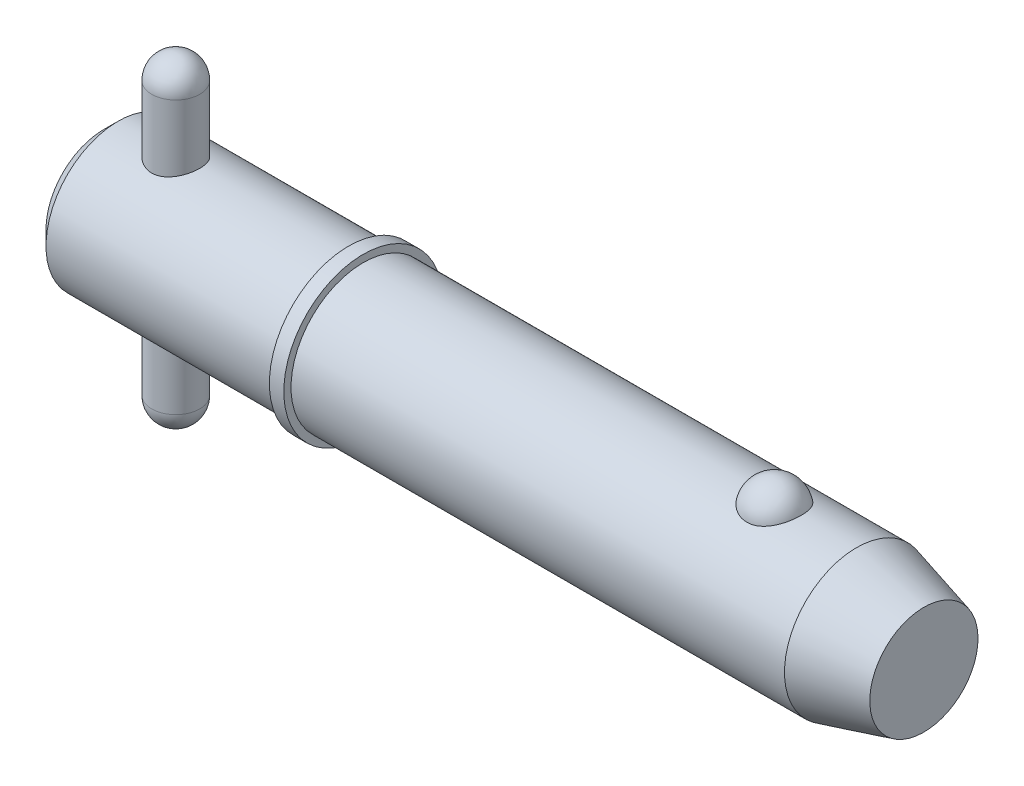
ISO-10303-21;
HEADER;
FILE_DESCRIPTION(('STEP AP214'),'2;1');
FILE_NAME('part.step','',(''),(''),'','','');
FILE_SCHEMA(('AUTOMOTIVE_DESIGN { 1 0 10303 214 1 1 1 1 }'));
ENDSEC;
DATA;
#1=APPLICATION_CONTEXT('core data for automotive mechanical design processes');
#2=APPLICATION_PROTOCOL_DEFINITION('international standard','automotive_design',2000,#1);
#3=PRODUCT_CONTEXT('',#1,'mechanical');
#4=PRODUCT('Part','Part','',(#3));
#5=PRODUCT_RELATED_PRODUCT_CATEGORY('part','',(#4));
#6=PRODUCT_DEFINITION_FORMATION('','',#4);
#7=PRODUCT_DEFINITION_CONTEXT('part definition',#1,'design');
#8=PRODUCT_DEFINITION('design','',#6,#7);
#9=PRODUCT_DEFINITION_SHAPE('','',#8);
#10=(LENGTH_UNIT() NAMED_UNIT(*) SI_UNIT(.MILLI.,.METRE.));
#11=(NAMED_UNIT(*) PLANE_ANGLE_UNIT() SI_UNIT($,.RADIAN.));
#12=(NAMED_UNIT(*) SI_UNIT($,.STERADIAN.) SOLID_ANGLE_UNIT());
#13=UNCERTAINTY_MEASURE_WITH_UNIT(LENGTH_MEASURE(1.E-05),#10,'distance_accuracy_value','');
#14=(GEOMETRIC_REPRESENTATION_CONTEXT(3) GLOBAL_UNCERTAINTY_ASSIGNED_CONTEXT((#13)) GLOBAL_UNIT_ASSIGNED_CONTEXT((#10,
#11,#12)) REPRESENTATION_CONTEXT('',''));
#15=CARTESIAN_POINT('',(0.,0.,0.));
#16=DIRECTION('',(0.,0.,1.));
#17=DIRECTION('',(1.,0.,0.));
#18=AXIS2_PLACEMENT_3D('',#15,#16,#17);
#19=CARTESIAN_POINT('',(7.14,15.875,0.));
#20=DIRECTION('',(0.,-1.,0.));
#21=DIRECTION('',(0.,0.,-1.));
#22=AXIS2_PLACEMENT_3D('',#19,#20,#21);
#23=CYLINDRICAL_SURFACE('',#22,2.38);
#24=CARTESIAN_POINT('',(7.14,-13.495,0.));
#25=DIRECTION('',(0.,-1.,0.));
#26=DIRECTION('',(0.,0.,-1.));
#27=AXIS2_PLACEMENT_3D('',#24,#25,#26);
#28=CIRCLE('',#27,2.38);
#29=CARTESIAN_POINT('',(7.14,-13.495,-2.38));
#30=VERTEX_POINT('',#29);
#31=EDGE_CURVE('P0_E10',#30,#30,#28,.F.);
#32=ORIENTED_EDGE('',*,*,#31,.T.);
#33=EDGE_LOOP('',(#32));
#34=FACE_BOUND('',#33,.T.);
#35=CARTESIAN_POINT('',(7.14,13.495,0.));
#36=DIRECTION('',(0.,-1.,0.));
#37=DIRECTION('',(0.,0.,-1.));
#38=AXIS2_PLACEMENT_3D('',#35,#36,#37);
#39=CIRCLE('',#38,2.38);
#40=CARTESIAN_POINT('',(7.14,13.495,-2.38));
#41=VERTEX_POINT('',#40);
#42=EDGE_CURVE('P0_E21',#41,#41,#39,.T.);
#43=ORIENTED_EDGE('',*,*,#42,.T.);
#44=EDGE_LOOP('',(#43));
#45=FACE_BOUND('',#44,.T.);
#46=ADVANCED_FACE('P0_F14',(#34,#45),#23,.T.);
#47=CARTESIAN_POINT('',(7.14,-13.495,0.));
#48=DIRECTION('',(0.,0.,1.));
#49=DIRECTION('',(1.,0.,0.));
#50=AXIS2_PLACEMENT_3D('',#47,#48,#49);
#51=SPHERICAL_SURFACE('',#50,2.38);
#52=CARTESIAN_POINT('',(7.14,-13.495,0.));
#53=DIRECTION('',(0.,-1.,0.));
#54=DIRECTION('',(0.,0.,-1.));
#55=AXIS2_PLACEMENT_3D('',#52,#53,#54);
#56=SPHERICAL_SURFACE('',#55,2.38);
#57=ORIENTED_EDGE('',*,*,#31,.F.);
#58=EDGE_LOOP('',(#57));
#59=FACE_BOUND('',#58,.T.);
#60=ADVANCED_FACE('P0_F29',(#59),#56,.T.);
#61=CARTESIAN_POINT('',(7.14,13.495,0.));
#62=DIRECTION('',(0.,0.,1.));
#63=DIRECTION('',(1.,0.,0.));
#64=AXIS2_PLACEMENT_3D('',#61,#62,#63);
#65=SPHERICAL_SURFACE('',#64,2.38);
#66=CARTESIAN_POINT('',(7.14,13.495,0.));
#67=DIRECTION('',(0.,-1.,0.));
#68=DIRECTION('',(0.,0.,-1.));
#69=AXIS2_PLACEMENT_3D('',#66,#67,#68);
#70=SPHERICAL_SURFACE('',#69,2.38);
#71=ORIENTED_EDGE('',*,*,#42,.F.);
#72=EDGE_LOOP('',(#71));
#73=FACE_BOUND('',#72,.T.);
#74=ADVANCED_FACE('P0_F16',(#73),#70,.T.);
#75=CLOSED_SHELL('',(#46,#60,#74));
#76=MANIFOLD_SOLID_BREP('P0_B1',#75);
#77=CARTESIAN_POINT('',(0.,0.,0.));
#78=DIRECTION('',(1.,0.,0.));
#79=DIRECTION('',(0.,0.,-1.));
#80=AXIS2_PLACEMENT_3D('',#77,#78,#79);
#81=CYLINDRICAL_SURFACE('',#80,7.145);
#82=CARTESIAN_POINT('',(74.5836242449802,0.,0.));
#83=DIRECTION('',(1.,0.,0.));
#84=DIRECTION('',(0.,0.,-1.));
#85=AXIS2_PLACEMENT_3D('',#82,#83,#84);
#86=CIRCLE('',#85,7.145);
#87=CARTESIAN_POINT('',(74.5836242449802,0.,-7.145));
#88=VERTEX_POINT('',#87);
#89=EDGE_CURVE('P1_E81',#88,#88,#86,.T.);
#90=ORIENTED_EDGE('',*,*,#89,.F.);
#91=EDGE_LOOP('',(#90));
#92=FACE_BOUND('',#91,.T.);
#93=CARTESIAN_POINT('',(25.7,0.,0.));
#94=DIRECTION('',(1.,0.,0.));
#95=DIRECTION('',(0.,0.,-1.));
#96=AXIS2_PLACEMENT_3D('',#93,#94,#95);
#97=CIRCLE('',#96,7.145);
#98=CARTESIAN_POINT('',(25.7,0.,-7.145));
#99=VERTEX_POINT('',#98);
#100=EDGE_CURVE('P1_E85',#99,#99,#97,.T.);
#101=ORIENTED_EDGE('',*,*,#100,.T.);
#102=EDGE_LOOP('',(#101));
#103=FACE_BOUND('',#102,.T.);
#104=CARTESIAN_POINT('',(66.4395037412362,6.60328629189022,2.72903557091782));
#105=CARTESIAN_POINT('',(66.2983158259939,6.60329644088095,2.72902496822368));
#106=CARTESIAN_POINT('',(66.1568832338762,6.60799490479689,2.71772840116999));
#107=CARTESIAN_POINT('',(65.8779557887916,6.62628236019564,2.67281935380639));
#108=CARTESIAN_POINT('',(65.7404726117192,6.63989534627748,2.63914664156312));
#109=CARTESIAN_POINT('',(65.4738894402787,6.67440775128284,2.55059642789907));
#110=CARTESIAN_POINT('',(65.3447683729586,6.69528793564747,2.49577486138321));
#111=CARTESIAN_POINT('',(65.0978694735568,6.74205585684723,2.36651799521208));
#112=CARTESIAN_POINT('',(64.9800865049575,6.76794130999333,2.29209163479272));
#113=CARTESIAN_POINT('',(64.7551671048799,6.82286177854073,2.12312937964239));
#114=CARTESIAN_POINT('',(64.6484405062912,6.85196655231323,2.02807107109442));
#115=CARTESIAN_POINT('',(64.4519181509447,6.90970232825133,1.82167822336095));
#116=CARTESIAN_POINT('',(64.3621276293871,6.93833318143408,1.71033867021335));
#117=CARTESIAN_POINT('',(64.1976670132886,6.9935167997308,1.46891951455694));
#118=CARTESIAN_POINT('',(64.123844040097,7.01992110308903,1.33822781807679));
#119=CARTESIAN_POINT('',(63.9980884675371,7.06643385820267,1.0656656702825));
#120=CARTESIAN_POINT('',(63.9461573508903,7.08654188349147,0.923794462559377));
#121=CARTESIAN_POINT('',(63.8647323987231,7.11862399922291,0.630993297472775));
#122=CARTESIAN_POINT('',(63.8355167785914,7.13049704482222,0.479974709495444));
#123=CARTESIAN_POINT('',(63.8011742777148,7.14449484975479,0.174782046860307));
#124=CARTESIAN_POINT('',(63.7960466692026,7.14661990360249,0.0206080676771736));
#125=CARTESIAN_POINT('',(63.809938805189,7.14092465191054,-0.285506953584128));
#126=CARTESIAN_POINT('',(63.8288101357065,7.1331654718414,-0.437455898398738));
#127=CARTESIAN_POINT('',(63.8900622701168,7.10859076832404,-0.73577860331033));
#128=CARTESIAN_POINT('',(63.9324435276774,7.0917750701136,-0.882152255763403));
#129=CARTESIAN_POINT('',(64.0399346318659,7.05076716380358,-1.16543149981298));
#130=CARTESIAN_POINT('',(64.1050759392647,7.02656475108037,-1.30232366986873));
#131=CARTESIAN_POINT('',(64.2567597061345,6.97329145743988,-1.56265907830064));
#132=CARTESIAN_POINT('',(64.343303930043,6.94422017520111,-1.68610120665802));
#133=CARTESIAN_POINT('',(64.5364654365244,6.88415108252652,-1.91671004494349));
#134=CARTESIAN_POINT('',(64.6431807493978,6.85314438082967,-2.02379244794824));
#135=CARTESIAN_POINT('',(64.8739740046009,6.79282069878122,-2.21787433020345));
#136=CARTESIAN_POINT('',(64.9980505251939,6.76350358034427,-2.30487545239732));
#137=CARTESIAN_POINT('',(65.2576784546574,6.7106058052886,-2.45458647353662));
#138=CARTESIAN_POINT('',(65.3929387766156,6.68691885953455,-2.5177624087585));
#139=CARTESIAN_POINT('',(65.6732778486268,6.64741247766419,-2.62030218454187));
#140=CARTESIAN_POINT('',(65.818352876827,6.63159007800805,-2.65967499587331));
#141=CARTESIAN_POINT('',(66.1063475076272,6.61038594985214,-2.71193301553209));
#142=CARTESIAN_POINT('',(66.2490080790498,6.60451880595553,-2.72605165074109));
#143=CARTESIAN_POINT('',(66.5348004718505,6.60240611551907,-2.73116688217));
#144=CARTESIAN_POINT('',(66.6779321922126,6.60615862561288,-2.72216814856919));
#145=CARTESIAN_POINT('',(66.9558486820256,6.6225609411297,-2.68200435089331));
#146=CARTESIAN_POINT('',(67.0907542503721,6.63492533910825,-2.65154998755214));
#147=CARTESIAN_POINT('',(67.35332009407,6.66687445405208,-2.57015684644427));
#148=CARTESIAN_POINT('',(67.4809797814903,6.68645975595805,-2.51921640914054));
#149=CARTESIAN_POINT('',(67.728577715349,6.73127274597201,-2.39693610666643));
#150=CARTESIAN_POINT('',(67.8482878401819,6.7566138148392,-2.32517694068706));
#151=CARTESIAN_POINT('',(68.0741592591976,6.8100600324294,-2.1636381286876));
#152=CARTESIAN_POINT('',(68.180317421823,6.83816581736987,-2.07385432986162));
#153=CARTESIAN_POINT('',(68.3818620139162,6.89580469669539,-1.87357235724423));
#154=CARTESIAN_POINT('',(68.476440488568,6.92533863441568,-1.76226074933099));
#155=CARTESIAN_POINT('',(68.6463329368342,6.98139526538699,-1.52511696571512));
#156=CARTESIAN_POINT('',(68.7216434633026,7.0079174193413,-1.39928219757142));
#157=CARTESIAN_POINT('',(68.8535955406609,7.05607625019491,-1.1321597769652));
#158=CARTESIAN_POINT('',(68.9095688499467,7.07753119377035,-0.990508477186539));
#159=CARTESIAN_POINT('',(68.9982965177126,7.11222355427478,-0.699154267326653));
#160=CARTESIAN_POINT('',(69.0310506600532,7.12546089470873,-0.549451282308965));
#161=CARTESIAN_POINT('',(69.0726899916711,7.1423758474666,-0.246120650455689));
#162=CARTESIAN_POINT('',(69.081558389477,7.14604673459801,-0.0924903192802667));
#163=CARTESIAN_POINT('',(69.0751940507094,7.14343510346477,0.214181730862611));
#164=CARTESIAN_POINT('',(69.0599618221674,7.13715279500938,0.367223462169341));
#165=CARTESIAN_POINT('',(69.0058451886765,7.11532948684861,0.667595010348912));
#166=CARTESIAN_POINT('',(68.9670776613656,7.09983424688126,0.814949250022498));
#167=CARTESIAN_POINT('',(68.8667700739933,7.06119140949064,1.10063221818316));
#168=CARTESIAN_POINT('',(68.8052284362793,7.03804328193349,1.23896032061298));
#169=CARTESIAN_POINT('',(68.6602071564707,6.98632429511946,1.5035230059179));
#170=CARTESIAN_POINT('',(68.5766067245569,6.95772382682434,1.62968561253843));
#171=CARTESIAN_POINT('',(68.3893804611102,6.89823072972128,1.865543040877));
#172=CARTESIAN_POINT('',(68.2857557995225,6.86733823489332,1.9752388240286));
#173=CARTESIAN_POINT('',(68.0610769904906,6.80676456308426,2.17482293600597));
#174=CARTESIAN_POINT('',(67.9400673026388,6.77708053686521,2.26476035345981));
#175=CARTESIAN_POINT('',(67.6833408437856,6.7223050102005,2.42252989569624));
#176=CARTESIAN_POINT('',(67.54761851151,6.69721525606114,2.49035362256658));
#177=CARTESIAN_POINT('',(67.2704022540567,6.65552591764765,2.59967646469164));
#178=CARTESIAN_POINT('',(67.1292810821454,6.63865794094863,2.64202017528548));
#179=CARTESIAN_POINT('',(66.8414448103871,6.61425039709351,2.70255841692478));
#180=CARTESIAN_POINT('',(66.6947480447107,6.60668259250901,2.720826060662));
#181=CARTESIAN_POINT('',(66.5116799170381,6.60358754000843,2.72830331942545));
#182=CARTESIAN_POINT('',(66.4755998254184,6.60328369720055,2.72903828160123));
#183=CARTESIAN_POINT('',(66.4395037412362,6.60328629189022,2.72903557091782));
#184=B_SPLINE_CURVE_WITH_KNOTS('',3,(#104,#105,#106,#107,#108,#109,#110,#111,#112,#113,#114,
#115,#116,#117,#118,#119,#120,#121,#122,#123,#124,#125,#126,#127,#128,#129,#130,#131,#132,#133,
#134,#135,#136,#137,#138,#139,#140,#141,#142,#143,#144,#145,#146,#147,#148,#149,#150,#151,#152,
#153,#154,#155,#156,#157,#158,#159,#160,#161,#162,#163,#164,#165,#166,#167,#168,#169,#170,#171,
#172,#173,#174,#175,#176,#177,#178,#179,#180,#181,#182,#183),.UNSPECIFIED.,.T.,.F.,(4,2,2,2,2,2,
2,2,2,2,2,2,2,2,2,2,2,2,2,2,2,2,2,2,2,2,2,2,2,2,2,2,2,2,2,2,2,2,2,4),(0.,0.423468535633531,
0.848081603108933,1.27157926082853,1.69488414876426,2.13051395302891,2.56627819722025,
3.0213670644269,3.47648674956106,3.93709649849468,4.39769233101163,4.85545355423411,
5.31322361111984,5.77162895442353,6.23007210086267,6.69080337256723,7.15149693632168,
7.60264329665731,8.05361952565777,8.48189729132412,8.91008854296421,9.32472524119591,
9.73939553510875,10.1630783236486,10.5868588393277,11.0319070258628,11.4770347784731,
11.9362874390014,12.3955443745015,12.855124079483,13.3146940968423,13.7720003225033,
14.2293382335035,14.6892343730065,15.1491036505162,15.6078171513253,16.0667046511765,
16.5093965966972,16.9507410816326,17.059004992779),.UNSPECIFIED.);
#185=CARTESIAN_POINT('',(66.4395037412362,6.60328629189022,2.72903557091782));
#186=VERTEX_POINT('',#185);
#187=EDGE_CURVE('P1_E35',#186,#186,#184,.T.);
#188=ORIENTED_EDGE('',*,*,#187,.T.);
#189=EDGE_LOOP('',(#188));
#190=FACE_BOUND('',#189,.T.);
#191=ADVANCED_FACE('P1_F13',(#92,#103,#190),#81,.T.);
#192=CARTESIAN_POINT('',(0.,0.,0.));
#193=DIRECTION('',(-1.,0.,0.));
#194=DIRECTION('',(0.,0.,1.));
#195=AXIS2_PLACEMENT_3D('',#192,#193,#194);
#196=PLANE('',#195);
#197=CARTESIAN_POINT('',(0.,0.,0.));
#198=DIRECTION('',(1.,0.,0.));
#199=DIRECTION('',(0.,0.,-1.));
#200=AXIS2_PLACEMENT_3D('',#197,#198,#199);
#201=CIRCLE('',#200,5.716);
#202=CARTESIAN_POINT('',(0.,0.,-5.716));
#203=VERTEX_POINT('',#202);
#204=EDGE_CURVE('P1_E9',#203,#203,#201,.T.);
#205=ORIENTED_EDGE('',*,*,#204,.F.);
#206=EDGE_LOOP('',(#205));
#207=FACE_BOUND('',#206,.T.);
#208=ADVANCED_FACE('P1_F15',(#207),#196,.T.);
#209=CARTESIAN_POINT('',(1.42899999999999,0.,0.));
#210=DIRECTION('',(1.,0.,0.));
#211=DIRECTION('',(0.,0.,-1.));
#212=AXIS2_PLACEMENT_3D('',#209,#210,#211);
#213=CONICAL_SURFACE('',#212,7.145,0.78539816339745);
#214=ORIENTED_EDGE('',*,*,#204,.T.);
#215=EDGE_LOOP('',(#214));
#216=FACE_BOUND('',#215,.T.);
#217=CARTESIAN_POINT('',(1.42899999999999,0.,0.));
#218=DIRECTION('',(1.,0.,0.));
#219=DIRECTION('',(0.,0.,-1.));
#220=AXIS2_PLACEMENT_3D('',#217,#218,#219);
#221=CIRCLE('',#220,7.145);
#222=CARTESIAN_POINT('',(1.42899999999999,0.,-7.145));
#223=VERTEX_POINT('',#222);
#224=EDGE_CURVE('P1_E26',#223,#223,#221,.T.);
#225=ORIENTED_EDGE('',*,*,#224,.F.);
#226=EDGE_LOOP('',(#225));
#227=FACE_BOUND('',#226,.T.);
#228=ADVANCED_FACE('P1_F77',(#216,#227),#213,.T.);
#229=CARTESIAN_POINT('',(0.,0.,0.));
#230=DIRECTION('',(1.,0.,0.));
#231=DIRECTION('',(0.,0.,-1.));
#232=AXIS2_PLACEMENT_3D('',#229,#230,#231);
#233=CYLINDRICAL_SURFACE('',#232,7.145);
#234=CARTESIAN_POINT('',(7.14,-6.73695962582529,2.38));
#235=CARTESIAN_POINT('',(7.01035997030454,-6.73695921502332,2.38000059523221));
#236=CARTESIAN_POINT('',(6.88072348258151,-6.74074253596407,2.36937183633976));
#237=CARTESIAN_POINT('',(6.62529075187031,-6.75538853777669,2.32728080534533));
#238=CARTESIAN_POINT('',(6.49949514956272,-6.76625239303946,2.29581507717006));
#239=CARTESIAN_POINT('',(6.2554858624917,-6.79369535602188,2.21327763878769));
#240=CARTESIAN_POINT('',(6.13725786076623,-6.81026326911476,2.16224430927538));
#241=CARTESIAN_POINT('',(5.91100349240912,-6.84723128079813,2.04215132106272));
#242=CARTESIAN_POINT('',(5.80297937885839,-6.86763222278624,1.97308769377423));
#243=CARTESIAN_POINT('',(5.59597854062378,-6.91086152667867,1.81600414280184));
#244=CARTESIAN_POINT('',(5.49745861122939,-6.93375032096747,1.72739874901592));
#245=CARTESIAN_POINT('',(5.31636508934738,-6.97886546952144,1.53499636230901));
#246=CARTESIAN_POINT('',(5.23379405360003,-7.00109171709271,1.43119693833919));
#247=CARTESIAN_POINT('',(5.08487013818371,-7.04307708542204,1.20801318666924));
#248=CARTESIAN_POINT('',(5.01899578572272,-7.06275685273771,1.08829330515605));
#249=CARTESIAN_POINT('',(4.90850130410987,-7.09671988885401,0.838703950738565));
#250=CARTESIAN_POINT('',(4.86387545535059,-7.11100460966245,0.70883722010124));
#251=CARTESIAN_POINT('',(4.79869354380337,-7.13213998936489,0.44742990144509));
#252=CARTESIAN_POINT('',(4.77735497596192,-7.13923172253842,0.316104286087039));
#253=CARTESIAN_POINT('',(4.75686536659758,-7.14603777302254,0.0515578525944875));
#254=CARTESIAN_POINT('',(4.75770861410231,-7.14575398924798,-0.0816624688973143));
#255=CARTESIAN_POINT('',(4.78106216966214,-7.13800438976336,-0.340678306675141));
#256=CARTESIAN_POINT('',(4.80272255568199,-7.13082030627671,-0.466560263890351));
#257=CARTESIAN_POINT('',(4.86569013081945,-7.11043095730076,-0.712788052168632));
#258=CARTESIAN_POINT('',(4.90699865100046,-7.09722528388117,-0.833133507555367));
#259=CARTESIAN_POINT('',(5.00858673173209,-7.06591754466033,-1.06673173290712));
#260=CARTESIAN_POINT('',(5.06910834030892,-7.0477534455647,-1.17987058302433));
#261=CARTESIAN_POINT('',(5.20720514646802,-7.00841977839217,-1.39463797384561));
#262=CARTESIAN_POINT('',(5.28478508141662,-6.987249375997,-1.49626330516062));
#263=CARTESIAN_POINT('',(5.4590800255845,-6.94296010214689,-1.69017445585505));
#264=CARTESIAN_POINT('',(5.55652324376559,-6.91979641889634,-1.78179645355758));
#265=CARTESIAN_POINT('',(5.76558873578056,-6.87497076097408,-1.94761348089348));
#266=CARTESIAN_POINT('',(5.87721318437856,-6.85330901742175,-2.02180583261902));
#267=CARTESIAN_POINT('',(6.11357367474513,-6.81369485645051,-2.15157488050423));
#268=CARTESIAN_POINT('',(6.23847358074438,-6.79579956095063,-2.20687188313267));
#269=CARTESIAN_POINT('',(6.49655785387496,-6.76640630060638,-2.29542443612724));
#270=CARTESIAN_POINT('',(6.62973872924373,-6.75490565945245,-2.32868920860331));
#271=CARTESIAN_POINT('',(6.89417536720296,-6.74020933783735,-2.37088225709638));
#272=CARTESIAN_POINT('',(7.02524746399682,-6.73666278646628,-2.38083959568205));
#273=CARTESIAN_POINT('',(7.28721035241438,-6.73729555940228,-2.37904974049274));
#274=CARTESIAN_POINT('',(7.41810117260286,-6.7414734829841,-2.36730648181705));
#275=CARTESIAN_POINT('',(7.67130717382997,-6.75673471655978,-2.32337336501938));
#276=CARTESIAN_POINT('',(7.79376251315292,-6.76757635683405,-2.29189834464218));
#277=CARTESIAN_POINT('',(8.03162917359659,-6.79467771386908,-2.21025275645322));
#278=CARTESIAN_POINT('',(8.14703924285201,-6.8109383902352,-2.16007887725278));
#279=CARTESIAN_POINT('',(8.37159169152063,-6.84768362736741,-2.04065289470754));
#280=CARTESIAN_POINT('',(8.48041962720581,-6.86828569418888,-1.97084668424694));
#281=CARTESIAN_POINT('',(8.68518919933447,-6.91116416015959,-1.8147657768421));
#282=CARTESIAN_POINT('',(8.78112702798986,-6.93344105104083,-1.72848623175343));
#283=CARTESIAN_POINT('',(8.96215574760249,-6.97845348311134,-1.53698616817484));
#284=CARTESIAN_POINT('',(9.04650427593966,-7.00115965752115,-1.43105491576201));
#285=CARTESIAN_POINT('',(9.19627592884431,-7.04341676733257,-1.20598377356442));
#286=CARTESIAN_POINT('',(9.26169972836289,-7.06296781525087,-1.08684435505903));
#287=CARTESIAN_POINT('',(9.37116617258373,-7.0966205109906,-0.83933303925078));
#288=CARTESIAN_POINT('',(9.41534821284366,-7.11075755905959,-0.711027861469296));
#289=CARTESIAN_POINT('',(9.48132660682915,-7.13214194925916,-0.448245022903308));
#290=CARTESIAN_POINT('',(9.50313102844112,-7.13939177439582,-0.313769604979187));
#291=CARTESIAN_POINT('',(9.5230098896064,-7.14599771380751,-0.049254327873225));
#292=CARTESIAN_POINT('',(9.52215013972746,-7.14570837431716,0.0806974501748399));
#293=CARTESIAN_POINT('',(9.49935359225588,-7.13814116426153,0.338518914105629));
#294=CARTESIAN_POINT('',(9.47741850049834,-7.13086385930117,0.466388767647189));
#295=CARTESIAN_POINT('',(9.4138005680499,-7.11026814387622,0.714400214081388));
#296=CARTESIAN_POINT('',(9.37243609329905,-7.09704726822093,0.834632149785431));
#297=CARTESIAN_POINT('',(9.27142829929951,-7.06592602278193,1.06649582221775));
#298=CARTESIAN_POINT('',(9.2117816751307,-7.04802480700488,1.1781259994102));
#299=CARTESIAN_POINT('',(9.07336776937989,-7.00856499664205,1.39411030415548));
#300=CARTESIAN_POINT('',(8.99397590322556,-6.98689577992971,1.49804368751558));
#301=CARTESIAN_POINT('',(8.81938810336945,-6.9426110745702,1.69146078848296));
#302=CARTESIAN_POINT('',(8.72418713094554,-6.91999528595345,1.78093988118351));
#303=CARTESIAN_POINT('',(8.51623540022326,-6.87531507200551,1.94646188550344));
#304=CARTESIAN_POINT('',(8.4029442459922,-6.85330672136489,2.02184316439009));
#305=CARTESIAN_POINT('',(8.16461714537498,-6.81342065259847,2.1524427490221));
#306=CARTESIAN_POINT('',(8.03958429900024,-6.7955418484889,2.20766635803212));
#307=CARTESIAN_POINT('',(7.78712566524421,-6.76686117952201,2.29403636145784));
#308=CARTESIAN_POINT('',(7.66006989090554,-6.75577342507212,2.32616709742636));
#309=CARTESIAN_POINT('',(7.40200728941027,-6.74082409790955,2.36914495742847));
#310=CARTESIAN_POINT('',(7.27100183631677,-6.73696004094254,2.37999939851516));
#311=CARTESIAN_POINT('',(7.14,-6.73695962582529,2.38));
#312=B_SPLINE_CURVE_WITH_KNOTS('',3,(#234,#235,#236,#237,#238,#239,#240,#241,#242,#243,#244,
#245,#246,#247,#248,#249,#250,#251,#252,#253,#254,#255,#256,#257,#258,#259,#260,#261,#262,#263,
#264,#265,#266,#267,#268,#269,#270,#271,#272,#273,#274,#275,#276,#277,#278,#279,#280,#281,#282,
#283,#284,#285,#286,#287,#288,#289,#290,#291,#292,#293,#294,#295,#296,#297,#298,#299,#300,#301,
#302,#303,#304,#305,#306,#307,#308,#309,#310,#311),.UNSPECIFIED.,.T.,.F.,(4,2,2,2,2,2,2,2,2,2,2,
2,2,2,2,2,2,2,2,2,2,2,2,2,2,2,2,2,2,2,2,2,2,2,2,2,2,2,4),(0.,0.388434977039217,
0.776934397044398,1.16467566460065,1.55250234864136,1.9540847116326,2.35573139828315,
2.76784120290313,3.17984001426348,3.57752248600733,3.97510257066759,4.35711073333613,
4.7391447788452,5.12619663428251,5.51335611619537,5.91871976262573,6.3241456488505,
6.73533623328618,7.14635459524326,7.53885245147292,7.93127914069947,8.31025106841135,
8.68929014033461,9.08033871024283,9.47150254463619,9.88145528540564,10.2913934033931,
10.6986033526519,11.1056664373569,11.4936225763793,11.8815473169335,12.2633262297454,
12.645174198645,13.0411187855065,13.437189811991,13.8487371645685,14.2601761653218,
14.6528265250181,15.0453418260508),.UNSPECIFIED.);
#313=CARTESIAN_POINT('',(7.14,-6.73695962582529,2.38));
#314=VERTEX_POINT('',#313);
#315=EDGE_CURVE('P1_E17',#314,#314,#312,.T.);
#316=ORIENTED_EDGE('',*,*,#315,.F.);
#317=EDGE_LOOP('',(#316));
#318=FACE_BOUND('',#317,.T.);
#319=CARTESIAN_POINT('',(7.14,6.73695962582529,2.38));
#320=CARTESIAN_POINT('',(7.26964002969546,6.73695921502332,2.38000059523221));
#321=CARTESIAN_POINT('',(7.39927651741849,6.74074253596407,2.36937183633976));
#322=CARTESIAN_POINT('',(7.65470924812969,6.75538853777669,2.32728080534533));
#323=CARTESIAN_POINT('',(7.78050485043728,6.76625239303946,2.29581507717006));
#324=CARTESIAN_POINT('',(8.02451413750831,6.79369535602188,2.21327763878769));
#325=CARTESIAN_POINT('',(8.14274213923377,6.81026326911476,2.16224430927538));
#326=CARTESIAN_POINT('',(8.36899650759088,6.84723128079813,2.04215132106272));
#327=CARTESIAN_POINT('',(8.47702062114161,6.86763222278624,1.97308769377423));
#328=CARTESIAN_POINT('',(8.68402145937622,6.91086152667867,1.81600414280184));
#329=CARTESIAN_POINT('',(8.78254138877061,6.93375032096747,1.72739874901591));
#330=CARTESIAN_POINT('',(8.96363491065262,6.97886546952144,1.53499636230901));
#331=CARTESIAN_POINT('',(9.04620594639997,7.00109171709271,1.43119693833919));
#332=CARTESIAN_POINT('',(9.19512986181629,7.04307708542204,1.20801318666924));
#333=CARTESIAN_POINT('',(9.26100421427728,7.06275685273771,1.08829330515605));
#334=CARTESIAN_POINT('',(9.37149869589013,7.09671988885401,0.838703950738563));
#335=CARTESIAN_POINT('',(9.41612454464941,7.11100460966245,0.708837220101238));
#336=CARTESIAN_POINT('',(9.48130645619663,7.13213998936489,0.447429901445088));
#337=CARTESIAN_POINT('',(9.50264502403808,7.13923172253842,0.316104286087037));
#338=CARTESIAN_POINT('',(9.52313463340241,7.14603777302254,0.0515578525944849));
#339=CARTESIAN_POINT('',(9.52229138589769,7.14575398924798,-0.0816624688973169));
#340=CARTESIAN_POINT('',(9.49893783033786,7.13800438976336,-0.340678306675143));
#341=CARTESIAN_POINT('',(9.47727744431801,7.13082030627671,-0.466560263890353));
#342=CARTESIAN_POINT('',(9.41430986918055,7.11043095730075,-0.712788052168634));
#343=CARTESIAN_POINT('',(9.37300134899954,7.09722528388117,-0.833133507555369));
#344=CARTESIAN_POINT('',(9.27141326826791,7.06591754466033,-1.06673173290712));
#345=CARTESIAN_POINT('',(9.21089165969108,7.0477534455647,-1.17987058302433));
#346=CARTESIAN_POINT('',(9.07279485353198,7.00841977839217,-1.39463797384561));
#347=CARTESIAN_POINT('',(8.99521491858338,6.987249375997,-1.49626330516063));
#348=CARTESIAN_POINT('',(8.82091997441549,6.94296010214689,-1.69017445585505));
#349=CARTESIAN_POINT('',(8.72347675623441,6.91979641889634,-1.78179645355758));
#350=CARTESIAN_POINT('',(8.51441126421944,6.87497076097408,-1.94761348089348));
#351=CARTESIAN_POINT('',(8.40278681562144,6.85330901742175,-2.02180583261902));
#352=CARTESIAN_POINT('',(8.16642632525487,6.81369485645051,-2.15157488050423));
#353=CARTESIAN_POINT('',(8.04152641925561,6.79579956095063,-2.20687188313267));
#354=CARTESIAN_POINT('',(7.78344214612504,6.76640630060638,-2.29542443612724));
#355=CARTESIAN_POINT('',(7.65026127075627,6.75490565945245,-2.32868920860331));
#356=CARTESIAN_POINT('',(7.38582463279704,6.74020933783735,-2.37088225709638));
#357=CARTESIAN_POINT('',(7.25475253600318,6.73666278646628,-2.38083959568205));
#358=CARTESIAN_POINT('',(6.99278964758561,6.73729555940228,-2.37904974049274));
#359=CARTESIAN_POINT('',(6.86189882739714,6.7414734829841,-2.36730648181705));
#360=CARTESIAN_POINT('',(6.60869282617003,6.75673471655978,-2.32337336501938));
#361=CARTESIAN_POINT('',(6.48623748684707,6.76757635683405,-2.29189834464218));
#362=CARTESIAN_POINT('',(6.2483708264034,6.79467771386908,-2.21025275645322));
#363=CARTESIAN_POINT('',(6.13296075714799,6.8109383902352,-2.16007887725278));
#364=CARTESIAN_POINT('',(5.90840830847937,6.84768362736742,-2.04065289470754));
#365=CARTESIAN_POINT('',(5.79958037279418,6.86828569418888,-1.97084668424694));
#366=CARTESIAN_POINT('',(5.59481080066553,6.91116416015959,-1.8147657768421));
#367=CARTESIAN_POINT('',(5.49887297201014,6.93344105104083,-1.72848623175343));
#368=CARTESIAN_POINT('',(5.31784425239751,6.97845348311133,-1.53698616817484));
#369=CARTESIAN_POINT('',(5.23349572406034,7.00115965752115,-1.43105491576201));
#370=CARTESIAN_POINT('',(5.08372407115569,7.04341676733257,-1.20598377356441));
#371=CARTESIAN_POINT('',(5.01830027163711,7.06296781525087,-1.08684435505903));
#372=CARTESIAN_POINT('',(4.90883382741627,7.0966205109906,-0.839333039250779));
#373=CARTESIAN_POINT('',(4.86465178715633,7.11075755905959,-0.711027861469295));
#374=CARTESIAN_POINT('',(4.79867339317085,7.13214194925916,-0.448245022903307));
#375=CARTESIAN_POINT('',(4.77686897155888,7.13939177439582,-0.313769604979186));
#376=CARTESIAN_POINT('',(4.7569901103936,7.14599771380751,-0.0492543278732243));
#377=CARTESIAN_POINT('',(4.75784986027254,7.14570837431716,0.0806974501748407));
#378=CARTESIAN_POINT('',(4.78064640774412,7.13814116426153,0.33851891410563));
#379=CARTESIAN_POINT('',(4.80258149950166,7.13086385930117,0.46638876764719));
#380=CARTESIAN_POINT('',(4.8661994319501,7.11026814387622,0.714400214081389));
#381=CARTESIAN_POINT('',(4.90756390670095,7.09704726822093,0.834632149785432));
#382=CARTESIAN_POINT('',(5.00857170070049,7.06592602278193,1.06649582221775));
#383=CARTESIAN_POINT('',(5.0682183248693,7.04802480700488,1.1781259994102));
#384=CARTESIAN_POINT('',(5.20663223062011,7.00856499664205,1.39411030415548));
#385=CARTESIAN_POINT('',(5.28602409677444,6.98689577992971,1.49804368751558));
#386=CARTESIAN_POINT('',(5.46061189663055,6.9426110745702,1.69146078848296));
#387=CARTESIAN_POINT('',(5.55581286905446,6.91999528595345,1.78093988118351));
#388=CARTESIAN_POINT('',(5.76376459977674,6.87531507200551,1.94646188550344));
#389=CARTESIAN_POINT('',(5.8770557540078,6.85330672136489,2.02184316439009));
#390=CARTESIAN_POINT('',(6.11538285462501,6.81342065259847,2.1524427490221));
#391=CARTESIAN_POINT('',(6.24041570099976,6.7955418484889,2.20766635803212));
#392=CARTESIAN_POINT('',(6.4928743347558,6.76686117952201,2.29403636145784));
#393=CARTESIAN_POINT('',(6.61993010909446,6.75577342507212,2.32616709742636));
#394=CARTESIAN_POINT('',(6.87799271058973,6.74082409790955,2.36914495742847));
#395=CARTESIAN_POINT('',(7.00899816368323,6.73696004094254,2.37999939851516));
#396=CARTESIAN_POINT('',(7.14,6.73695962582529,2.38));
#397=B_SPLINE_CURVE_WITH_KNOTS('',3,(#319,#320,#321,#322,#323,#324,#325,#326,#327,#328,#329,
#330,#331,#332,#333,#334,#335,#336,#337,#338,#339,#340,#341,#342,#343,#344,#345,#346,#347,#348,
#349,#350,#351,#352,#353,#354,#355,#356,#357,#358,#359,#360,#361,#362,#363,#364,#365,#366,#367,
#368,#369,#370,#371,#372,#373,#374,#375,#376,#377,#378,#379,#380,#381,#382,#383,#384,#385,#386,
#387,#388,#389,#390,#391,#392,#393,#394,#395,#396),.UNSPECIFIED.,.T.,.F.,(4,2,2,2,2,2,2,2,2,2,2,
2,2,2,2,2,2,2,2,2,2,2,2,2,2,2,2,2,2,2,2,2,2,2,2,2,2,2,4),(0.,0.388434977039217,
0.776934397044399,1.16467566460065,1.55250234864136,1.9540847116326,2.35573139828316,
2.76784120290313,3.17984001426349,3.57752248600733,3.97510257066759,4.35711073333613,
4.73914477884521,5.12619663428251,5.51335611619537,5.91871976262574,6.3241456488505,
6.73533623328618,7.14635459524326,7.53885245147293,7.93127914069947,8.31025106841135,
8.68929014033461,9.08033871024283,9.47150254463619,9.88145528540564,10.2913934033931,
10.6986033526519,11.1056664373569,11.4936225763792,11.8815473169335,12.2633262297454,
12.645174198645,13.0411187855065,13.437189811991,13.8487371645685,14.2601761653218,
14.6528265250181,15.0453418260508),.UNSPECIFIED.);
#398=CARTESIAN_POINT('',(7.14,6.73695962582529,2.38));
#399=VERTEX_POINT('',#398);
#400=EDGE_CURVE('P1_E43',#399,#399,#397,.T.);
#401=ORIENTED_EDGE('',*,*,#400,.F.);
#402=EDGE_LOOP('',(#401));
#403=FACE_BOUND('',#402,.T.);
#404=ORIENTED_EDGE('',*,*,#224,.T.);
#405=EDGE_LOOP('',(#404));
#406=FACE_BOUND('',#405,.T.);
#407=CARTESIAN_POINT('',(24.271,0.,0.));
#408=DIRECTION('',(1.,0.,0.));
#409=DIRECTION('',(0.,0.,-1.));
#410=AXIS2_PLACEMENT_3D('',#407,#408,#409);
#411=CIRCLE('',#410,7.145);
#412=CARTESIAN_POINT('',(24.271,0.,-7.145));
#413=VERTEX_POINT('',#412);
#414=EDGE_CURVE('P1_E31',#413,#413,#411,.T.);
#415=ORIENTED_EDGE('',*,*,#414,.F.);
#416=EDGE_LOOP('',(#415));
#417=FACE_BOUND('',#416,.T.);
#418=ADVANCED_FACE('P1_F103',(#318,#403,#406,#417),#233,.T.);
#419=CARTESIAN_POINT('',(24.271,7.145,0.));
#420=DIRECTION('',(-1.,0.,0.));
#421=DIRECTION('',(0.,0.,1.));
#422=AXIS2_PLACEMENT_3D('',#419,#420,#421);
#423=PLANE('',#422);
#424=ORIENTED_EDGE('',*,*,#414,.T.);
#425=EDGE_LOOP('',(#424));
#426=FACE_BOUND('',#425,.T.);
#427=CARTESIAN_POINT('',(24.271,0.,0.));
#428=DIRECTION('',(1.,0.,0.));
#429=DIRECTION('',(0.,0.,-1.));
#430=AXIS2_PLACEMENT_3D('',#427,#428,#429);
#431=CIRCLE('',#430,7.8595);
#432=CARTESIAN_POINT('',(24.271,0.,-7.8595));
#433=VERTEX_POINT('',#432);
#434=EDGE_CURVE('P1_E91',#433,#433,#431,.T.);
#435=ORIENTED_EDGE('',*,*,#434,.F.);
#436=EDGE_LOOP('',(#435));
#437=FACE_BOUND('',#436,.T.);
#438=ADVANCED_FACE('P1_F100',(#426,#437),#423,.T.);
#439=CARTESIAN_POINT('',(0.,0.,0.));
#440=DIRECTION('',(1.,0.,0.));
#441=DIRECTION('',(0.,0.,-1.));
#442=AXIS2_PLACEMENT_3D('',#439,#440,#441);
#443=CYLINDRICAL_SURFACE('',#442,7.8595);
#444=ORIENTED_EDGE('',*,*,#434,.T.);
#445=EDGE_LOOP('',(#444));
#446=FACE_BOUND('',#445,.T.);
#447=CARTESIAN_POINT('',(25.7,0.,0.));
#448=DIRECTION('',(1.,0.,0.));
#449=DIRECTION('',(0.,0.,-1.));
#450=AXIS2_PLACEMENT_3D('',#447,#448,#449);
#451=CIRCLE('',#450,7.8595);
#452=CARTESIAN_POINT('',(25.7,0.,-7.8595));
#453=VERTEX_POINT('',#452);
#454=EDGE_CURVE('P1_E88',#453,#453,#451,.T.);
#455=ORIENTED_EDGE('',*,*,#454,.F.);
#456=EDGE_LOOP('',(#455));
#457=FACE_BOUND('',#456,.T.);
#458=ADVANCED_FACE('P1_F68',(#446,#457),#443,.T.);
#459=CARTESIAN_POINT('',(25.7,7.8595,0.));
#460=DIRECTION('',(1.,0.,0.));
#461=DIRECTION('',(0.,0.,-1.));
#462=AXIS2_PLACEMENT_3D('',#459,#460,#461);
#463=PLANE('',#462);
#464=ORIENTED_EDGE('',*,*,#454,.T.);
#465=EDGE_LOOP('',(#464));
#466=FACE_BOUND('',#465,.T.);
#467=ORIENTED_EDGE('',*,*,#100,.F.);
#468=EDGE_LOOP('',(#467));
#469=FACE_BOUND('',#468,.T.);
#470=ADVANCED_FACE('P1_F62',(#466,#469),#463,.T.);
#471=CARTESIAN_POINT('',(81.25,0.,0.));
#472=DIRECTION('',(-1.,0.,0.));
#473=DIRECTION('',(0.,0.,1.));
#474=AXIS2_PLACEMENT_3D('',#471,#472,#473);
#475=CONICAL_SURFACE('',#474,5.35875000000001,0.261799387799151);
#476=ORIENTED_EDGE('',*,*,#89,.T.);
#477=EDGE_LOOP('',(#476));
#478=FACE_BOUND('',#477,.T.);
#479=CARTESIAN_POINT('',(81.25,0.,0.));
#480=DIRECTION('',(1.,0.,0.));
#481=DIRECTION('',(0.,0.,-1.));
#482=AXIS2_PLACEMENT_3D('',#479,#480,#481);
#483=CIRCLE('',#482,5.35875000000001);
#484=CARTESIAN_POINT('',(81.25,0.,-5.35875000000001));
#485=VERTEX_POINT('',#484);
#486=EDGE_CURVE('P1_E42',#485,#485,#483,.T.);
#487=ORIENTED_EDGE('',*,*,#486,.F.);
#488=EDGE_LOOP('',(#487));
#489=FACE_BOUND('',#488,.T.);
#490=ADVANCED_FACE('P1_F59',(#478,#489),#475,.T.);
#491=CARTESIAN_POINT('',(81.25,5.35875000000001,0.));
#492=DIRECTION('',(1.,0.,0.));
#493=DIRECTION('',(0.,0.,-1.));
#494=AXIS2_PLACEMENT_3D('',#491,#492,#493);
#495=PLANE('',#494);
#496=ORIENTED_EDGE('',*,*,#486,.T.);
#497=EDGE_LOOP('',(#496));
#498=FACE_BOUND('',#497,.T.);
#499=ADVANCED_FACE('P1_F55',(#498),#495,.T.);
#500=CARTESIAN_POINT('',(66.4395037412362,6.4305,0.));
#501=DIRECTION('',(-1.,0.,0.));
#502=DIRECTION('',(0.,-1.,0.));
#503=AXIS2_PLACEMENT_3D('',#500,#501,#502);
#504=SPHERICAL_SURFACE('',#503,2.73449999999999);
#505=ORIENTED_EDGE('',*,*,#187,.F.);
#506=EDGE_LOOP('',(#505));
#507=FACE_BOUND('',#506,.T.);
#508=ADVANCED_FACE('P1_F50',(#507),#504,.T.);
#509=CARTESIAN_POINT('',(7.14,-7.8595,0.));
#510=DIRECTION('',(0.,1.,0.));
#511=DIRECTION('',(0.,0.,1.));
#512=AXIS2_PLACEMENT_3D('',#509,#510,#511);
#513=CYLINDRICAL_SURFACE('',#512,2.38);
#514=ORIENTED_EDGE('',*,*,#315,.T.);
#515=EDGE_LOOP('',(#514));
#516=FACE_BOUND('',#515,.T.);
#517=ORIENTED_EDGE('',*,*,#400,.T.);
#518=EDGE_LOOP('',(#517));
#519=FACE_BOUND('',#518,.T.);
#520=ADVANCED_FACE('P1_F54',(#516,#519),#513,.F.);
#521=CLOSED_SHELL('',(#191,#208,#228,#418,#438,#458,#470,#490,#499,#508,#520));
#522=MANIFOLD_SOLID_BREP('P1_B1',#521);
#523=ADVANCED_BREP_SHAPE_REPRESENTATION('',(#18,#76,#522),#14);
#524=SHAPE_DEFINITION_REPRESENTATION(#9,#523);
ENDSEC;
END-ISO-10303-21;
